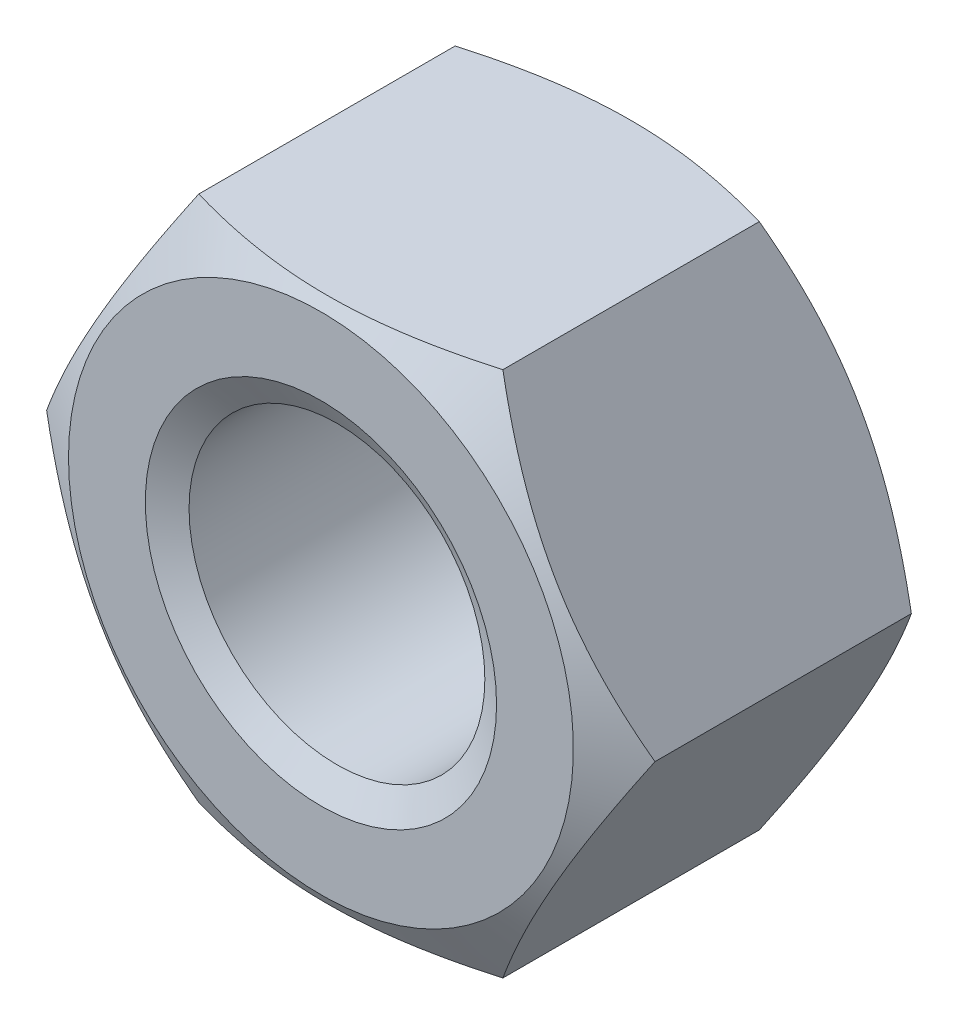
from build123d import *
from OCP.BRepFilletAPI import BRepFilletAPI_MakeChamfer

# Parameters (mm, degrees)
SKETCH1_R        = 5.053
BASENUT_DEPTH    = 10.8
ENDCHAMFER_SIZE  = 0.947
ENDCHAMFER_SIZE2 = 0.546750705


with BuildPart() as part:
    # Sketch1 → BaseNut (new body)
    with BuildSketch(Plane.XY):
        Polygon((10.392304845, 0), (5.196152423, 9), (-5.196152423, 9), (-10.392304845, 0), (-5.196152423, -9), (5.196152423, -9), align=None)
        Circle(SKETCH1_R, mode=Mode.SUBTRACT)
    extrude(amount=-BASENUT_DEPTH)

    # Sketch2 → Double-Chamfer (revolve, cut)
    with BuildSketch(Plane(origin=(0, 0, 0), x_dir=(1, 0, 0), z_dir=(0, 1, 0))):
        Polygon((-10.392304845, 10.8), (-8.625, 10.8), (-10.392304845, 9.779646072), align=None)
        Polygon((-10.392304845, 1.020353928), (-10.392304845, 0), (-8.625, 0), align=None)
    revolve(axis=Axis((0, 0, -3.375940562), (0, 0, 1)), mode=Mode.SUBTRACT)

    # EndChamfer: one chamfer whose edges measure the first distance from different faces: ONE call of the kernel's chamfer builder (chamfer() names one face for all edges)
    endchamfer_edges_1 = [part.edges().sort_by_distance(p)[0] for p in [
        (-5.053, 0, -10.8),
    ]]
    endchamfer_side_1 = [part.faces().sort_by_distance(p)[0] for p in [
        (-5.053, 0, -5.4),
    ]]
    endchamfer_edges_2 = [part.edges().sort_by_distance(p)[0] for p in [
        (-5.053, 0, 0),
    ]]
    endchamfer_side_2 = [part.faces().sort_by_distance(p)[0] for p in [
        (8.38104816, 0, 0),
    ]]
    endchamfer = BRepFilletAPI_MakeChamfer(part.part.solid().wrapped)
    for e in endchamfer_edges_1:
        endchamfer.Add(ENDCHAMFER_SIZE, ENDCHAMFER_SIZE2, e.wrapped, endchamfer_side_1[0].wrapped)  # the first distance lies on this face
    for e in endchamfer_edges_2:
        endchamfer.Add(ENDCHAMFER_SIZE, ENDCHAMFER_SIZE2, e.wrapped, endchamfer_side_2[0].wrapped)  # the first distance lies on this face
    add(Compound.cast(endchamfer.Shape()), mode=Mode.REPLACE)


solid = part.part
